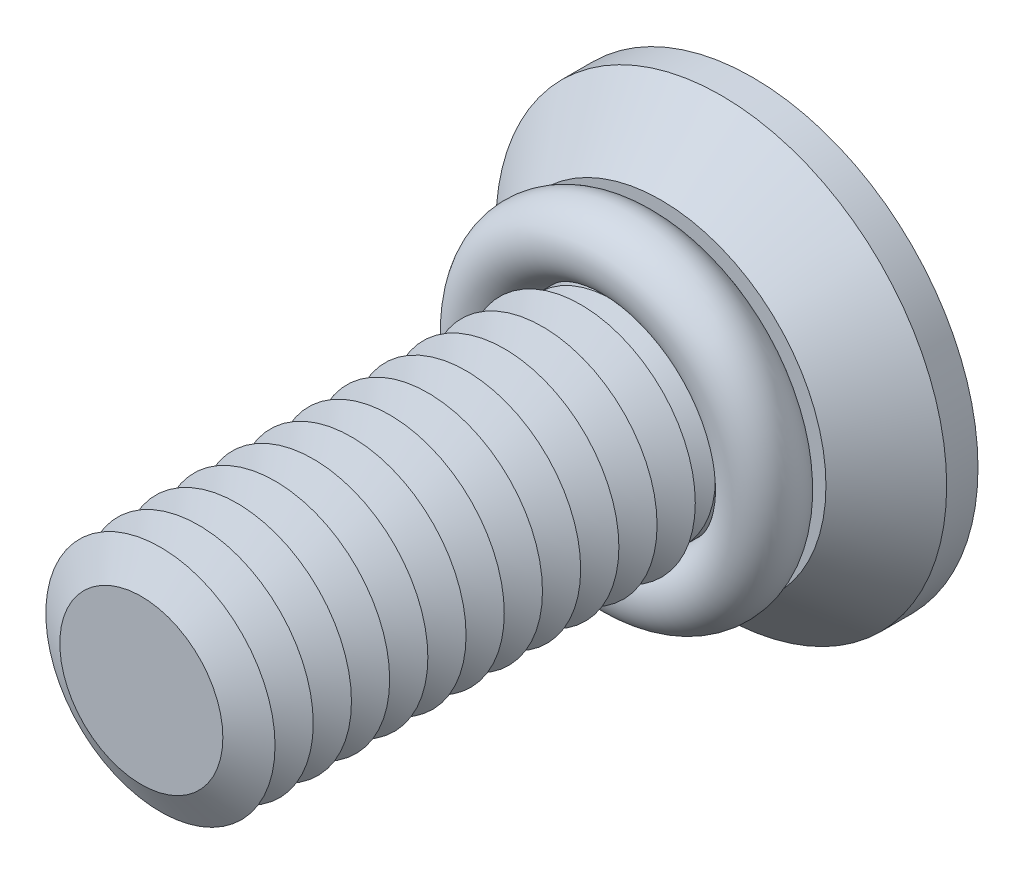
ISO-10303-21;
HEADER;
FILE_DESCRIPTION(('STEP AP214'),'2;1');
FILE_NAME('part.step','',(''),(''),'','','');
FILE_SCHEMA(('AUTOMOTIVE_DESIGN { 1 0 10303 214 1 1 1 1 }'));
ENDSEC;
DATA;
#1=APPLICATION_CONTEXT('core data for automotive mechanical design processes');
#2=APPLICATION_PROTOCOL_DEFINITION('international standard','automotive_design',2000,#1);
#3=PRODUCT_CONTEXT('',#1,'mechanical');
#4=PRODUCT('Part','Part','',(#3));
#5=PRODUCT_RELATED_PRODUCT_CATEGORY('part','',(#4));
#6=PRODUCT_DEFINITION_FORMATION('','',#4);
#7=PRODUCT_DEFINITION_CONTEXT('part definition',#1,'design');
#8=PRODUCT_DEFINITION('design','',#6,#7);
#9=PRODUCT_DEFINITION_SHAPE('','',#8);
#10=(LENGTH_UNIT() NAMED_UNIT(*) SI_UNIT(.MILLI.,.METRE.));
#11=(NAMED_UNIT(*) PLANE_ANGLE_UNIT() SI_UNIT($,.RADIAN.));
#12=(NAMED_UNIT(*) SI_UNIT($,.STERADIAN.) SOLID_ANGLE_UNIT());
#13=UNCERTAINTY_MEASURE_WITH_UNIT(LENGTH_MEASURE(1.E-05),#10,'distance_accuracy_value','');
#14=(GEOMETRIC_REPRESENTATION_CONTEXT(3) GLOBAL_UNCERTAINTY_ASSIGNED_CONTEXT((#13)) GLOBAL_UNIT_ASSIGNED_CONTEXT((#10,
#11,#12)) REPRESENTATION_CONTEXT('',''));
#15=CARTESIAN_POINT('',(0.,0.,0.));
#16=DIRECTION('',(0.,0.,1.));
#17=DIRECTION('',(1.,0.,0.));
#18=AXIS2_PLACEMENT_3D('',#15,#16,#17);
#19=CARTESIAN_POINT('',(0.,0.,3.30000000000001));
#20=DIRECTION('',(0.,0.,1.));
#21=DIRECTION('',(1.,0.,0.));
#22=AXIS2_PLACEMENT_3D('',#19,#20,#21);
#23=TOROIDAL_SURFACE('',#22,3.6,0.9);
#24=CARTESIAN_POINT('',(0.,3.6,3.30000000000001));
#25=DIRECTION('',(1.,0.,0.));
#26=DIRECTION('',(0.,0.,-1.));
#27=AXIS2_PLACEMENT_3D('',#24,#25,#26);
#28=CIRCLE('',#27,0.9);
#29=CARTESIAN_POINT('',(0.,4.5,3.30000000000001));
#30=VERTEX_POINT('',#29);
#31=EDGE_CURVE('P0_E10',#30,#30,#28,.T.);
#32=CARTESIAN_POINT('',(0.,0.,3.30000000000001));
#33=DIRECTION('',(0.,0.,1.));
#34=DIRECTION('',(1.,0.,0.));
#35=AXIS2_PLACEMENT_3D('',#32,#33,#34);
#36=CIRCLE('',#35,4.5);
#37=EDGE_CURVE('',#30,#30,#36,.T.);
#38=ORIENTED_EDGE('',*,*,#31,.F.);
#39=ORIENTED_EDGE('',*,*,#31,.T.);
#40=ORIENTED_EDGE('',*,*,#37,.T.);
#41=ORIENTED_EDGE('',*,*,#37,.F.);
#42=EDGE_LOOP('',(#38,#40,#39,#41));
#43=FACE_BOUND('',#42,.T.);
#44=ADVANCED_FACE('P0_F14',(#43),#23,.T.);
#45=CLOSED_SHELL('',(#44));
#46=MANIFOLD_SOLID_BREP('P0_B1',#45);
#47=CARTESIAN_POINT('',(0.,0.,11.));
#48=DIRECTION('',(0.,0.,-1.));
#49=DIRECTION('',(-1.,0.,0.));
#50=AXIS2_PLACEMENT_3D('',#47,#48,#49);
#51=CONICAL_SURFACE('',#50,2.13397459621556,1.0471975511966);
#52=CARTESIAN_POINT('',(0.,0.,10.5));
#53=DIRECTION('',(0.,0.,1.));
#54=DIRECTION('',(1.,0.,0.));
#55=AXIS2_PLACEMENT_3D('',#52,#53,#54);
#56=CIRCLE('',#55,3.);
#57=CARTESIAN_POINT('',(3.,0.,10.5));
#58=VERTEX_POINT('',#57);
#59=EDGE_CURVE('P1_E324',#58,#58,#56,.T.);
#60=ORIENTED_EDGE('',*,*,#59,.T.);
#61=EDGE_LOOP('',(#60));
#62=FACE_BOUND('',#61,.T.);
#63=CARTESIAN_POINT('',(0.,0.,11.));
#64=DIRECTION('',(0.,0.,1.));
#65=DIRECTION('',(1.,0.,0.));
#66=AXIS2_PLACEMENT_3D('',#63,#64,#65);
#67=CIRCLE('',#66,2.13397459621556);
#68=CARTESIAN_POINT('',(2.13397459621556,0.,11.));
#69=VERTEX_POINT('',#68);
#70=EDGE_CURVE('P1_E321',#69,#69,#67,.T.);
#71=ORIENTED_EDGE('',*,*,#70,.F.);
#72=EDGE_LOOP('',(#71));
#73=FACE_BOUND('',#72,.T.);
#74=ADVANCED_FACE('P1_F15',(#62,#73),#51,.T.);
#75=CARTESIAN_POINT('',(0.,0.,11.5));
#76=DIRECTION('',(0.,0.,1.));
#77=DIRECTION('',(1.,0.,0.));
#78=AXIS2_PLACEMENT_3D('',#75,#76,#77);
#79=CONICAL_SURFACE('',#78,3.,1.0471975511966);
#80=ORIENTED_EDGE('',*,*,#70,.T.);
#81=EDGE_LOOP('',(#80));
#82=FACE_BOUND('',#81,.T.);
#83=CARTESIAN_POINT('',(0.,0.,11.5));
#84=DIRECTION('',(0.,0.,1.));
#85=DIRECTION('',(1.,0.,0.));
#86=AXIS2_PLACEMENT_3D('',#83,#84,#85);
#87=CIRCLE('',#86,3.);
#88=CARTESIAN_POINT('',(3.,0.,11.5));
#89=VERTEX_POINT('',#88);
#90=EDGE_CURVE('P1_E318',#89,#89,#87,.T.);
#91=ORIENTED_EDGE('',*,*,#90,.F.);
#92=EDGE_LOOP('',(#91));
#93=FACE_BOUND('',#92,.T.);
#94=ADVANCED_FACE('P1_F245',(#82,#93),#79,.T.);
#95=CARTESIAN_POINT('',(0.,0.,16.));
#96=DIRECTION('',(0.,0.,1.));
#97=DIRECTION('',(1.,0.,0.));
#98=AXIS2_PLACEMENT_3D('',#95,#96,#97);
#99=PLANE('',#98);
#100=CARTESIAN_POINT('',(0.,0.,16.));
#101=DIRECTION('',(0.,0.,1.));
#102=DIRECTION('',(1.,0.,0.));
#103=AXIS2_PLACEMENT_3D('',#100,#101,#102);
#104=CIRCLE('',#103,2.13397459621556);
#105=CARTESIAN_POINT('',(2.13397459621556,0.,16.));
#106=VERTEX_POINT('',#105);
#107=EDGE_CURVE('P1_E131',#106,#106,#104,.T.);
#108=ORIENTED_EDGE('',*,*,#107,.T.);
#109=EDGE_LOOP('',(#108));
#110=FACE_BOUND('',#109,.T.);
#111=ADVANCED_FACE('P1_F251',(#110),#99,.T.);
#112=CARTESIAN_POINT('',(0.,0.,16.));
#113=DIRECTION('',(0.,0.,-1.));
#114=DIRECTION('',(-1.,0.,0.));
#115=AXIS2_PLACEMENT_3D('',#112,#113,#114);
#116=CONICAL_SURFACE('',#115,2.13397459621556,1.0471975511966);
#117=CARTESIAN_POINT('',(0.,0.,15.5));
#118=DIRECTION('',(0.,0.,1.));
#119=DIRECTION('',(1.,0.,0.));
#120=AXIS2_PLACEMENT_3D('',#117,#118,#119);
#121=CIRCLE('',#120,3.);
#122=CARTESIAN_POINT('',(3.,0.,15.5));
#123=VERTEX_POINT('',#122);
#124=EDGE_CURVE('P1_E133',#123,#123,#121,.T.);
#125=ORIENTED_EDGE('',*,*,#124,.T.);
#126=EDGE_LOOP('',(#125));
#127=FACE_BOUND('',#126,.T.);
#128=ORIENTED_EDGE('',*,*,#107,.F.);
#129=EDGE_LOOP('',(#128));
#130=FACE_BOUND('',#129,.T.);
#131=ADVANCED_FACE('P1_F196',(#127,#130),#116,.T.);
#132=CARTESIAN_POINT('',(0.,0.,15.5));
#133=DIRECTION('',(0.,0.,1.));
#134=DIRECTION('',(1.,0.,0.));
#135=AXIS2_PLACEMENT_3D('',#132,#133,#134);
#136=CONICAL_SURFACE('',#135,3.,1.0471975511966);
#137=CARTESIAN_POINT('',(0.,0.,15.));
#138=DIRECTION('',(0.,0.,1.));
#139=DIRECTION('',(1.,0.,0.));
#140=AXIS2_PLACEMENT_3D('',#137,#138,#139);
#141=CIRCLE('',#140,2.13397459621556);
#142=CARTESIAN_POINT('',(2.13397459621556,0.,15.));
#143=VERTEX_POINT('',#142);
#144=EDGE_CURVE('P1_E297',#143,#143,#141,.T.);
#145=ORIENTED_EDGE('',*,*,#144,.T.);
#146=EDGE_LOOP('',(#145));
#147=FACE_BOUND('',#146,.T.);
#148=ORIENTED_EDGE('',*,*,#124,.F.);
#149=EDGE_LOOP('',(#148));
#150=FACE_BOUND('',#149,.T.);
#151=ADVANCED_FACE('P1_F284',(#147,#150),#136,.T.);
#152=CARTESIAN_POINT('',(0.,0.,15.));
#153=DIRECTION('',(0.,0.,-1.));
#154=DIRECTION('',(-1.,0.,0.));
#155=AXIS2_PLACEMENT_3D('',#152,#153,#154);
#156=CONICAL_SURFACE('',#155,2.13397459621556,1.0471975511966);
#157=CARTESIAN_POINT('',(0.,0.,14.5));
#158=DIRECTION('',(0.,0.,1.));
#159=DIRECTION('',(1.,0.,0.));
#160=AXIS2_PLACEMENT_3D('',#157,#158,#159);
#161=CIRCLE('',#160,3.);
#162=CARTESIAN_POINT('',(3.,0.,14.5));
#163=VERTEX_POINT('',#162);
#164=EDGE_CURVE('P1_E294',#163,#163,#161,.T.);
#165=ORIENTED_EDGE('',*,*,#164,.T.);
#166=EDGE_LOOP('',(#165));
#167=FACE_BOUND('',#166,.T.);
#168=ORIENTED_EDGE('',*,*,#144,.F.);
#169=EDGE_LOOP('',(#168));
#170=FACE_BOUND('',#169,.T.);
#171=ADVANCED_FACE('P1_F279',(#167,#170),#156,.T.);
#172=CARTESIAN_POINT('',(0.,0.,14.5));
#173=DIRECTION('',(0.,0.,1.));
#174=DIRECTION('',(1.,0.,0.));
#175=AXIS2_PLACEMENT_3D('',#172,#173,#174);
#176=CONICAL_SURFACE('',#175,3.,1.0471975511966);
#177=CARTESIAN_POINT('',(0.,0.,14.));
#178=DIRECTION('',(0.,0.,1.));
#179=DIRECTION('',(1.,0.,0.));
#180=AXIS2_PLACEMENT_3D('',#177,#178,#179);
#181=CIRCLE('',#180,2.13397459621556);
#182=CARTESIAN_POINT('',(2.13397459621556,0.,14.));
#183=VERTEX_POINT('',#182);
#184=EDGE_CURVE('P1_E301',#183,#183,#181,.T.);
#185=ORIENTED_EDGE('',*,*,#184,.T.);
#186=EDGE_LOOP('',(#185));
#187=FACE_BOUND('',#186,.T.);
#188=ORIENTED_EDGE('',*,*,#164,.F.);
#189=EDGE_LOOP('',(#188));
#190=FACE_BOUND('',#189,.T.);
#191=ADVANCED_FACE('P1_F276',(#187,#190),#176,.T.);
#192=CARTESIAN_POINT('',(0.,0.,14.));
#193=DIRECTION('',(0.,0.,-1.));
#194=DIRECTION('',(-1.,0.,0.));
#195=AXIS2_PLACEMENT_3D('',#192,#193,#194);
#196=CONICAL_SURFACE('',#195,2.13397459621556,1.0471975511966);
#197=CARTESIAN_POINT('',(0.,0.,13.5));
#198=DIRECTION('',(0.,0.,1.));
#199=DIRECTION('',(1.,0.,0.));
#200=AXIS2_PLACEMENT_3D('',#197,#198,#199);
#201=CIRCLE('',#200,3.);
#202=CARTESIAN_POINT('',(3.,0.,13.5));
#203=VERTEX_POINT('',#202);
#204=EDGE_CURVE('P1_E306',#203,#203,#201,.T.);
#205=ORIENTED_EDGE('',*,*,#204,.T.);
#206=EDGE_LOOP('',(#205));
#207=FACE_BOUND('',#206,.T.);
#208=ORIENTED_EDGE('',*,*,#184,.F.);
#209=EDGE_LOOP('',(#208));
#210=FACE_BOUND('',#209,.T.);
#211=ADVANCED_FACE('P1_F271',(#207,#210),#196,.T.);
#212=CARTESIAN_POINT('',(0.,0.,13.5));
#213=DIRECTION('',(0.,0.,1.));
#214=DIRECTION('',(1.,0.,0.));
#215=AXIS2_PLACEMENT_3D('',#212,#213,#214);
#216=CONICAL_SURFACE('',#215,3.,1.0471975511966);
#217=CARTESIAN_POINT('',(0.,0.,13.));
#218=DIRECTION('',(0.,0.,1.));
#219=DIRECTION('',(1.,0.,0.));
#220=AXIS2_PLACEMENT_3D('',#217,#218,#219);
#221=CIRCLE('',#220,2.13397459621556);
#222=CARTESIAN_POINT('',(2.13397459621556,0.,13.));
#223=VERTEX_POINT('',#222);
#224=EDGE_CURVE('P1_E309',#223,#223,#221,.T.);
#225=ORIENTED_EDGE('',*,*,#224,.T.);
#226=EDGE_LOOP('',(#225));
#227=FACE_BOUND('',#226,.T.);
#228=ORIENTED_EDGE('',*,*,#204,.F.);
#229=EDGE_LOOP('',(#228));
#230=FACE_BOUND('',#229,.T.);
#231=ADVANCED_FACE('P1_F268',(#227,#230),#216,.T.);
#232=CARTESIAN_POINT('',(0.,0.,13.));
#233=DIRECTION('',(0.,0.,-1.));
#234=DIRECTION('',(-1.,0.,0.));
#235=AXIS2_PLACEMENT_3D('',#232,#233,#234);
#236=CONICAL_SURFACE('',#235,2.13397459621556,1.0471975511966);
#237=CARTESIAN_POINT('',(0.,0.,12.5));
#238=DIRECTION('',(0.,0.,1.));
#239=DIRECTION('',(1.,0.,0.));
#240=AXIS2_PLACEMENT_3D('',#237,#238,#239);
#241=CIRCLE('',#240,3.);
#242=CARTESIAN_POINT('',(3.,0.,12.5));
#243=VERTEX_POINT('',#242);
#244=EDGE_CURVE('P1_E312',#243,#243,#241,.T.);
#245=ORIENTED_EDGE('',*,*,#244,.T.);
#246=EDGE_LOOP('',(#245));
#247=FACE_BOUND('',#246,.T.);
#248=ORIENTED_EDGE('',*,*,#224,.F.);
#249=EDGE_LOOP('',(#248));
#250=FACE_BOUND('',#249,.T.);
#251=ADVANCED_FACE('P1_F262',(#247,#250),#236,.T.);
#252=CARTESIAN_POINT('',(0.,0.,12.5));
#253=DIRECTION('',(0.,0.,1.));
#254=DIRECTION('',(1.,0.,0.));
#255=AXIS2_PLACEMENT_3D('',#252,#253,#254);
#256=CONICAL_SURFACE('',#255,3.,1.0471975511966);
#257=CARTESIAN_POINT('',(0.,0.,12.));
#258=DIRECTION('',(0.,0.,1.));
#259=DIRECTION('',(1.,0.,0.));
#260=AXIS2_PLACEMENT_3D('',#257,#258,#259);
#261=CIRCLE('',#260,2.13397459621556);
#262=CARTESIAN_POINT('',(2.13397459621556,0.,12.));
#263=VERTEX_POINT('',#262);
#264=EDGE_CURVE('P1_E315',#263,#263,#261,.T.);
#265=ORIENTED_EDGE('',*,*,#264,.T.);
#266=EDGE_LOOP('',(#265));
#267=FACE_BOUND('',#266,.T.);
#268=ORIENTED_EDGE('',*,*,#244,.F.);
#269=EDGE_LOOP('',(#268));
#270=FACE_BOUND('',#269,.T.);
#271=ADVANCED_FACE('P1_F258',(#267,#270),#256,.T.);
#272=CARTESIAN_POINT('',(0.,0.,12.));
#273=DIRECTION('',(0.,0.,-1.));
#274=DIRECTION('',(-1.,0.,0.));
#275=AXIS2_PLACEMENT_3D('',#272,#273,#274);
#276=CONICAL_SURFACE('',#275,2.13397459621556,1.0471975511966);
#277=ORIENTED_EDGE('',*,*,#90,.T.);
#278=EDGE_LOOP('',(#277));
#279=FACE_BOUND('',#278,.T.);
#280=ORIENTED_EDGE('',*,*,#264,.F.);
#281=EDGE_LOOP('',(#280));
#282=FACE_BOUND('',#281,.T.);
#283=ADVANCED_FACE('P1_F261',(#279,#282),#276,.T.);
#284=CARTESIAN_POINT('',(0.,0.,10.));
#285=DIRECTION('',(0.,0.,-1.));
#286=DIRECTION('',(-1.,0.,0.));
#287=AXIS2_PLACEMENT_3D('',#284,#285,#286);
#288=CONICAL_SURFACE('',#287,2.13397459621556,1.0471975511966);
#289=CARTESIAN_POINT('',(0.,0.,9.5));
#290=DIRECTION('',(0.,0.,1.));
#291=DIRECTION('',(1.,0.,0.));
#292=AXIS2_PLACEMENT_3D('',#289,#290,#291);
#293=CIRCLE('',#292,3.);
#294=CARTESIAN_POINT('',(3.,0.,9.5));
#295=VERTEX_POINT('',#294);
#296=EDGE_CURVE('P1_E329',#295,#295,#293,.T.);
#297=ORIENTED_EDGE('',*,*,#296,.T.);
#298=EDGE_LOOP('',(#297));
#299=FACE_BOUND('',#298,.T.);
#300=CARTESIAN_POINT('',(0.,0.,10.));
#301=DIRECTION('',(0.,0.,1.));
#302=DIRECTION('',(1.,0.,0.));
#303=AXIS2_PLACEMENT_3D('',#300,#301,#302);
#304=CIRCLE('',#303,2.13397459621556);
#305=CARTESIAN_POINT('',(2.13397459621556,0.,10.));
#306=VERTEX_POINT('',#305);
#307=EDGE_CURVE('P1_E326',#306,#306,#304,.T.);
#308=ORIENTED_EDGE('',*,*,#307,.F.);
#309=EDGE_LOOP('',(#308));
#310=FACE_BOUND('',#309,.T.);
#311=ADVANCED_FACE('P1_F266',(#299,#310),#288,.T.);
#312=CARTESIAN_POINT('',(0.,0.,10.5));
#313=DIRECTION('',(0.,0.,1.));
#314=DIRECTION('',(1.,0.,0.));
#315=AXIS2_PLACEMENT_3D('',#312,#313,#314);
#316=CONICAL_SURFACE('',#315,3.,1.0471975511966);
#317=ORIENTED_EDGE('',*,*,#307,.T.);
#318=EDGE_LOOP('',(#317));
#319=FACE_BOUND('',#318,.T.);
#320=ORIENTED_EDGE('',*,*,#59,.F.);
#321=EDGE_LOOP('',(#320));
#322=FACE_BOUND('',#321,.T.);
#323=ADVANCED_FACE('P1_F467',(#319,#322),#316,.T.);
#324=CARTESIAN_POINT('',(0.,0.,9.));
#325=DIRECTION('',(0.,0.,-1.));
#326=DIRECTION('',(-1.,0.,0.));
#327=AXIS2_PLACEMENT_3D('',#324,#325,#326);
#328=CONICAL_SURFACE('',#327,2.13397459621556,1.0471975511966);
#329=CARTESIAN_POINT('',(0.,0.,8.5));
#330=DIRECTION('',(0.,0.,1.));
#331=DIRECTION('',(1.,0.,0.));
#332=AXIS2_PLACEMENT_3D('',#329,#330,#331);
#333=CIRCLE('',#332,3.);
#334=CARTESIAN_POINT('',(3.,0.,8.5));
#335=VERTEX_POINT('',#334);
#336=EDGE_CURVE('P1_E335',#335,#335,#333,.T.);
#337=ORIENTED_EDGE('',*,*,#336,.T.);
#338=EDGE_LOOP('',(#337));
#339=FACE_BOUND('',#338,.T.);
#340=CARTESIAN_POINT('',(0.,0.,9.));
#341=DIRECTION('',(0.,0.,1.));
#342=DIRECTION('',(1.,0.,0.));
#343=AXIS2_PLACEMENT_3D('',#340,#341,#342);
#344=CIRCLE('',#343,2.13397459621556);
#345=CARTESIAN_POINT('',(2.13397459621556,0.,9.));
#346=VERTEX_POINT('',#345);
#347=EDGE_CURVE('P1_E332',#346,#346,#344,.T.);
#348=ORIENTED_EDGE('',*,*,#347,.F.);
#349=EDGE_LOOP('',(#348));
#350=FACE_BOUND('',#349,.T.);
#351=ADVANCED_FACE('P1_F476',(#339,#350),#328,.T.);
#352=CARTESIAN_POINT('',(0.,0.,9.5));
#353=DIRECTION('',(0.,0.,1.));
#354=DIRECTION('',(1.,0.,0.));
#355=AXIS2_PLACEMENT_3D('',#352,#353,#354);
#356=CONICAL_SURFACE('',#355,3.,1.0471975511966);
#357=ORIENTED_EDGE('',*,*,#347,.T.);
#358=EDGE_LOOP('',(#357));
#359=FACE_BOUND('',#358,.T.);
#360=ORIENTED_EDGE('',*,*,#296,.F.);
#361=EDGE_LOOP('',(#360));
#362=FACE_BOUND('',#361,.T.);
#363=ADVANCED_FACE('P1_F486',(#359,#362),#356,.T.);
#364=CARTESIAN_POINT('',(0.,0.,8.));
#365=DIRECTION('',(0.,0.,-1.));
#366=DIRECTION('',(-1.,0.,0.));
#367=AXIS2_PLACEMENT_3D('',#364,#365,#366);
#368=CONICAL_SURFACE('',#367,2.13397459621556,1.0471975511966);
#369=CARTESIAN_POINT('',(0.,0.,7.5));
#370=DIRECTION('',(0.,0.,1.));
#371=DIRECTION('',(1.,0.,0.));
#372=AXIS2_PLACEMENT_3D('',#369,#370,#371);
#373=CIRCLE('',#372,3.);
#374=CARTESIAN_POINT('',(3.,0.,7.5));
#375=VERTEX_POINT('',#374);
#376=EDGE_CURVE('P1_E341',#375,#375,#373,.T.);
#377=ORIENTED_EDGE('',*,*,#376,.T.);
#378=EDGE_LOOP('',(#377));
#379=FACE_BOUND('',#378,.T.);
#380=CARTESIAN_POINT('',(0.,0.,8.));
#381=DIRECTION('',(0.,0.,1.));
#382=DIRECTION('',(1.,0.,0.));
#383=AXIS2_PLACEMENT_3D('',#380,#381,#382);
#384=CIRCLE('',#383,2.13397459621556);
#385=CARTESIAN_POINT('',(2.13397459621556,0.,8.));
#386=VERTEX_POINT('',#385);
#387=EDGE_CURVE('P1_E338',#386,#386,#384,.T.);
#388=ORIENTED_EDGE('',*,*,#387,.F.);
#389=EDGE_LOOP('',(#388));
#390=FACE_BOUND('',#389,.T.);
#391=ADVANCED_FACE('P1_F496',(#379,#390),#368,.T.);
#392=CARTESIAN_POINT('',(0.,0.,8.5));
#393=DIRECTION('',(0.,0.,1.));
#394=DIRECTION('',(1.,0.,0.));
#395=AXIS2_PLACEMENT_3D('',#392,#393,#394);
#396=CONICAL_SURFACE('',#395,3.,1.0471975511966);
#397=ORIENTED_EDGE('',*,*,#387,.T.);
#398=EDGE_LOOP('',(#397));
#399=FACE_BOUND('',#398,.T.);
#400=ORIENTED_EDGE('',*,*,#336,.F.);
#401=EDGE_LOOP('',(#400));
#402=FACE_BOUND('',#401,.T.);
#403=ADVANCED_FACE('P1_F506',(#399,#402),#396,.T.);
#404=CARTESIAN_POINT('',(0.,0.,7.));
#405=DIRECTION('',(0.,0.,-1.));
#406=DIRECTION('',(-1.,0.,0.));
#407=AXIS2_PLACEMENT_3D('',#404,#405,#406);
#408=CONICAL_SURFACE('',#407,2.13397459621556,1.0471975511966);
#409=CARTESIAN_POINT('',(0.,0.,6.5));
#410=DIRECTION('',(0.,0.,1.));
#411=DIRECTION('',(1.,0.,0.));
#412=AXIS2_PLACEMENT_3D('',#409,#410,#411);
#413=CIRCLE('',#412,3.);
#414=CARTESIAN_POINT('',(3.,0.,6.5));
#415=VERTEX_POINT('',#414);
#416=EDGE_CURVE('P1_E347',#415,#415,#413,.T.);
#417=ORIENTED_EDGE('',*,*,#416,.T.);
#418=EDGE_LOOP('',(#417));
#419=FACE_BOUND('',#418,.T.);
#420=CARTESIAN_POINT('',(0.,0.,7.));
#421=DIRECTION('',(0.,0.,1.));
#422=DIRECTION('',(1.,0.,0.));
#423=AXIS2_PLACEMENT_3D('',#420,#421,#422);
#424=CIRCLE('',#423,2.13397459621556);
#425=CARTESIAN_POINT('',(2.13397459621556,0.,7.));
#426=VERTEX_POINT('',#425);
#427=EDGE_CURVE('P1_E344',#426,#426,#424,.T.);
#428=ORIENTED_EDGE('',*,*,#427,.F.);
#429=EDGE_LOOP('',(#428));
#430=FACE_BOUND('',#429,.T.);
#431=ADVANCED_FACE('P1_F516',(#419,#430),#408,.T.);
#432=CARTESIAN_POINT('',(0.,0.,7.5));
#433=DIRECTION('',(0.,0.,1.));
#434=DIRECTION('',(1.,0.,0.));
#435=AXIS2_PLACEMENT_3D('',#432,#433,#434);
#436=CONICAL_SURFACE('',#435,3.,1.0471975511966);
#437=ORIENTED_EDGE('',*,*,#427,.T.);
#438=EDGE_LOOP('',(#437));
#439=FACE_BOUND('',#438,.T.);
#440=ORIENTED_EDGE('',*,*,#376,.F.);
#441=EDGE_LOOP('',(#440));
#442=FACE_BOUND('',#441,.T.);
#443=ADVANCED_FACE('P1_F526',(#439,#442),#436,.T.);
#444=CARTESIAN_POINT('',(0.,0.,6.));
#445=DIRECTION('',(0.,0.,-1.));
#446=DIRECTION('',(-1.,0.,0.));
#447=AXIS2_PLACEMENT_3D('',#444,#445,#446);
#448=CONICAL_SURFACE('',#447,2.13397459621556,1.0471975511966);
#449=CARTESIAN_POINT('',(0.,0.,5.5));
#450=DIRECTION('',(0.,0.,1.));
#451=DIRECTION('',(1.,0.,0.));
#452=AXIS2_PLACEMENT_3D('',#449,#450,#451);
#453=CIRCLE('',#452,3.);
#454=CARTESIAN_POINT('',(3.,0.,5.5));
#455=VERTEX_POINT('',#454);
#456=EDGE_CURVE('P1_E353',#455,#455,#453,.T.);
#457=ORIENTED_EDGE('',*,*,#456,.T.);
#458=EDGE_LOOP('',(#457));
#459=FACE_BOUND('',#458,.T.);
#460=CARTESIAN_POINT('',(0.,0.,6.));
#461=DIRECTION('',(0.,0.,1.));
#462=DIRECTION('',(1.,0.,0.));
#463=AXIS2_PLACEMENT_3D('',#460,#461,#462);
#464=CIRCLE('',#463,2.13397459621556);
#465=CARTESIAN_POINT('',(2.13397459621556,0.,6.));
#466=VERTEX_POINT('',#465);
#467=EDGE_CURVE('P1_E350',#466,#466,#464,.T.);
#468=ORIENTED_EDGE('',*,*,#467,.F.);
#469=EDGE_LOOP('',(#468));
#470=FACE_BOUND('',#469,.T.);
#471=ADVANCED_FACE('P1_F536',(#459,#470),#448,.T.);
#472=CARTESIAN_POINT('',(0.,0.,6.5));
#473=DIRECTION('',(0.,0.,1.));
#474=DIRECTION('',(1.,0.,0.));
#475=AXIS2_PLACEMENT_3D('',#472,#473,#474);
#476=CONICAL_SURFACE('',#475,3.,1.0471975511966);
#477=ORIENTED_EDGE('',*,*,#467,.T.);
#478=EDGE_LOOP('',(#477));
#479=FACE_BOUND('',#478,.T.);
#480=ORIENTED_EDGE('',*,*,#416,.F.);
#481=EDGE_LOOP('',(#480));
#482=FACE_BOUND('',#481,.T.);
#483=ADVANCED_FACE('P1_F546',(#479,#482),#476,.T.);
#484=CARTESIAN_POINT('',(0.,0.,5.));
#485=DIRECTION('',(0.,0.,-1.));
#486=DIRECTION('',(-1.,0.,0.));
#487=AXIS2_PLACEMENT_3D('',#484,#485,#486);
#488=CONICAL_SURFACE('',#487,2.13397459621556,1.0471975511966);
#489=CARTESIAN_POINT('',(0.,0.,4.5));
#490=DIRECTION('',(0.,0.,1.));
#491=DIRECTION('',(1.,0.,0.));
#492=AXIS2_PLACEMENT_3D('',#489,#490,#491);
#493=CIRCLE('',#492,3.);
#494=CARTESIAN_POINT('',(3.,0.,4.5));
#495=VERTEX_POINT('',#494);
#496=EDGE_CURVE('P1_E359',#495,#495,#493,.T.);
#497=ORIENTED_EDGE('',*,*,#496,.T.);
#498=EDGE_LOOP('',(#497));
#499=FACE_BOUND('',#498,.T.);
#500=CARTESIAN_POINT('',(0.,0.,5.));
#501=DIRECTION('',(0.,0.,1.));
#502=DIRECTION('',(1.,0.,0.));
#503=AXIS2_PLACEMENT_3D('',#500,#501,#502);
#504=CIRCLE('',#503,2.13397459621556);
#505=CARTESIAN_POINT('',(2.13397459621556,0.,5.));
#506=VERTEX_POINT('',#505);
#507=EDGE_CURVE('P1_E356',#506,#506,#504,.T.);
#508=ORIENTED_EDGE('',*,*,#507,.F.);
#509=EDGE_LOOP('',(#508));
#510=FACE_BOUND('',#509,.T.);
#511=ADVANCED_FACE('P1_F556',(#499,#510),#488,.T.);
#512=CARTESIAN_POINT('',(0.,0.,5.5));
#513=DIRECTION('',(0.,0.,1.));
#514=DIRECTION('',(1.,0.,0.));
#515=AXIS2_PLACEMENT_3D('',#512,#513,#514);
#516=CONICAL_SURFACE('',#515,3.,1.0471975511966);
#517=ORIENTED_EDGE('',*,*,#507,.T.);
#518=EDGE_LOOP('',(#517));
#519=FACE_BOUND('',#518,.T.);
#520=ORIENTED_EDGE('',*,*,#456,.F.);
#521=EDGE_LOOP('',(#520));
#522=FACE_BOUND('',#521,.T.);
#523=ADVANCED_FACE('P1_F372',(#519,#522),#516,.T.);
#524=CARTESIAN_POINT('',(0.,0.,4.));
#525=DIRECTION('',(0.,0.,-1.));
#526=DIRECTION('',(-1.,0.,0.));
#527=AXIS2_PLACEMENT_3D('',#524,#525,#526);
#528=CONICAL_SURFACE('',#527,2.13397459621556,1.0471975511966);
#529=CARTESIAN_POINT('',(0.,0.,4.));
#530=DIRECTION('',(0.,0.,1.));
#531=DIRECTION('',(1.,0.,0.));
#532=AXIS2_PLACEMENT_3D('',#529,#530,#531);
#533=CIRCLE('',#532,2.13397459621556);
#534=CARTESIAN_POINT('',(2.13397459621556,0.,4.));
#535=VERTEX_POINT('',#534);
#536=EDGE_CURVE('P1_E362',#535,#535,#533,.T.);
#537=ORIENTED_EDGE('',*,*,#536,.F.);
#538=EDGE_LOOP('',(#537));
#539=FACE_BOUND('',#538,.T.);
#540=CARTESIAN_POINT('',(0.,0.,3.67320508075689));
#541=DIRECTION('',(0.,0.,-1.));
#542=DIRECTION('',(-1.,0.,0.));
#543=AXIS2_PLACEMENT_3D('',#540,#541,#542);
#544=CIRCLE('',#543,2.7);
#545=CARTESIAN_POINT('',(-2.7,0.,3.67320508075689));
#546=VERTEX_POINT('',#545);
#547=EDGE_CURVE('P1_E19',#546,#546,#544,.F.);
#548=ORIENTED_EDGE('',*,*,#547,.T.);
#549=EDGE_LOOP('',(#548));
#550=FACE_BOUND('',#549,.T.);
#551=ADVANCED_FACE('P1_F369',(#539,#550),#528,.T.);
#552=CARTESIAN_POINT('',(0.,0.,4.5));
#553=DIRECTION('',(0.,0.,1.));
#554=DIRECTION('',(1.,0.,0.));
#555=AXIS2_PLACEMENT_3D('',#552,#553,#554);
#556=CONICAL_SURFACE('',#555,3.,1.0471975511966);
#557=ORIENTED_EDGE('',*,*,#536,.T.);
#558=EDGE_LOOP('',(#557));
#559=FACE_BOUND('',#558,.T.);
#560=ORIENTED_EDGE('',*,*,#496,.F.);
#561=EDGE_LOOP('',(#560));
#562=FACE_BOUND('',#561,.T.);
#563=ADVANCED_FACE('P1_F366',(#559,#562),#556,.T.);
#564=CARTESIAN_POINT('',(0.,0.,2.5));
#565=DIRECTION('',(0.,0.,-1.));
#566=DIRECTION('',(-1.,0.,0.));
#567=AXIS2_PLACEMENT_3D('',#564,#565,#566);
#568=CONICAL_SURFACE('',#567,2.,1.0471975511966);
#569=CARTESIAN_POINT('',(0.,0.,3.65470053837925));
#570=VERTEX_POINT('',#569);
#571=VERTEX_LOOP('',#570);
#572=FACE_BOUND('',#571,.T.);
#573=CARTESIAN_POINT('',(0.,0.,2.5));
#574=DIRECTION('',(0.,0.,-1.));
#575=DIRECTION('',(-1.,0.,0.));
#576=AXIS2_PLACEMENT_3D('',#573,#574,#575);
#577=CIRCLE('',#576,2.);
#578=CARTESIAN_POINT('',(-2.,0.,2.5));
#579=VERTEX_POINT('',#578);
#580=CARTESIAN_POINT('',(-1.,1.73205080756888,2.5));
#581=VERTEX_POINT('',#580);
#582=EDGE_CURVE('P1_E117',#579,#581,#577,.T.);
#583=ORIENTED_EDGE('',*,*,#582,.T.);
#584=CARTESIAN_POINT('',(0.,0.,2.5));
#585=DIRECTION('',(0.,0.,-1.));
#586=DIRECTION('',(-1.,0.,0.));
#587=AXIS2_PLACEMENT_3D('',#584,#585,#586);
#588=CIRCLE('',#587,2.);
#589=CARTESIAN_POINT('',(1.,1.73205080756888,2.5));
#590=VERTEX_POINT('',#589);
#591=EDGE_CURVE('P1_E24',#581,#590,#588,.T.);
#592=ORIENTED_EDGE('',*,*,#591,.T.);
#593=CARTESIAN_POINT('',(2.,0.,2.5));
#594=VERTEX_POINT('',#593);
#595=EDGE_CURVE('P1_E791',#590,#594,#588,.T.);
#596=ORIENTED_EDGE('',*,*,#595,.T.);
#597=CARTESIAN_POINT('',(1.,-1.73205080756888,2.5));
#598=VERTEX_POINT('',#597);
#599=EDGE_CURVE('P1_E784',#594,#598,#588,.T.);
#600=ORIENTED_EDGE('',*,*,#599,.T.);
#601=CARTESIAN_POINT('',(-1.,-1.73205080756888,2.5));
#602=VERTEX_POINT('',#601);
#603=EDGE_CURVE('P1_E182',#598,#602,#588,.T.);
#604=ORIENTED_EDGE('',*,*,#603,.T.);
#605=EDGE_CURVE('P1_E179',#602,#579,#588,.T.);
#606=ORIENTED_EDGE('',*,*,#605,.T.);
#607=EDGE_LOOP('',(#583,#592,#596,#600,#604,#606));
#608=FACE_BOUND('',#607,.T.);
#609=ADVANCED_FACE('P1_F198',(#572,#608),#568,.F.);
#610=CARTESIAN_POINT('',(0.,0.,2.5));
#611=DIRECTION('',(0.,0.,-1.));
#612=DIRECTION('',(-1.,0.,0.));
#613=AXIS2_PLACEMENT_3D('',#610,#611,#612);
#614=PLANE('',#613);
#615=ORIENTED_EDGE('',*,*,#603,.F.);
#616=DIRECTION('',(-0.866025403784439,-0.5,0.));
#617=VECTOR('',#616,1.);
#618=CARTESIAN_POINT('',(2.,-1.15470053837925,2.5));
#619=LINE('',#618,#617);
#620=CARTESIAN_POINT('',(0.,-2.3094010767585,2.5));
#621=VERTEX_POINT('',#620);
#622=EDGE_CURVE('P1_E800',#598,#621,#619,.T.);
#623=ORIENTED_EDGE('',*,*,#622,.T.);
#624=DIRECTION('',(-0.866025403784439,0.5,0.));
#625=VECTOR('',#624,1.);
#626=CARTESIAN_POINT('',(0.,-2.3094010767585,2.5));
#627=LINE('',#626,#625);
#628=EDGE_CURVE('P1_E807',#621,#602,#627,.T.);
#629=ORIENTED_EDGE('',*,*,#628,.T.);
#630=EDGE_LOOP('',(#615,#623,#629));
#631=FACE_BOUND('',#630,.T.);
#632=ADVANCED_FACE('P1_F598',(#631),#614,.T.);
#633=ORIENTED_EDGE('',*,*,#605,.F.);
#634=CARTESIAN_POINT('',(-2.,-1.15470053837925,2.5));
#635=VERTEX_POINT('',#634);
#636=EDGE_CURVE('P1_E810',#602,#635,#627,.T.);
#637=ORIENTED_EDGE('',*,*,#636,.T.);
#638=DIRECTION('',(0.,1.,0.));
#639=VECTOR('',#638,1.);
#640=CARTESIAN_POINT('',(-2.,-1.15470053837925,2.5));
#641=LINE('',#640,#639);
#642=EDGE_CURVE('P1_E123',#635,#579,#641,.T.);
#643=ORIENTED_EDGE('',*,*,#642,.T.);
#644=EDGE_LOOP('',(#633,#637,#643));
#645=FACE_BOUND('',#644,.T.);
#646=ADVANCED_FACE('P1_F231',(#645),#614,.T.);
#647=ORIENTED_EDGE('',*,*,#582,.F.);
#648=CARTESIAN_POINT('',(-2.,1.15470053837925,2.5));
#649=VERTEX_POINT('',#648);
#650=EDGE_CURVE('P1_E812',#579,#649,#641,.T.);
#651=ORIENTED_EDGE('',*,*,#650,.T.);
#652=DIRECTION('',(0.866025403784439,0.5,0.));
#653=VECTOR('',#652,1.);
#654=CARTESIAN_POINT('',(-2.,1.15470053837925,2.5));
#655=LINE('',#654,#653);
#656=EDGE_CURVE('P1_E815',#649,#581,#655,.T.);
#657=ORIENTED_EDGE('',*,*,#656,.T.);
#658=EDGE_LOOP('',(#647,#651,#657));
#659=FACE_BOUND('',#658,.T.);
#660=ADVANCED_FACE('P1_F615',(#659),#614,.T.);
#661=ORIENTED_EDGE('',*,*,#591,.F.);
#662=CARTESIAN_POINT('',(0.,2.3094010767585,2.5));
#663=VERTEX_POINT('',#662);
#664=EDGE_CURVE('P1_E814',#581,#663,#655,.T.);
#665=ORIENTED_EDGE('',*,*,#664,.T.);
#666=DIRECTION('',(0.866025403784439,-0.5,0.));
#667=VECTOR('',#666,1.);
#668=CARTESIAN_POINT('',(0.,2.3094010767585,2.5));
#669=LINE('',#668,#667);
#670=EDGE_CURVE('P1_E161',#663,#590,#669,.T.);
#671=ORIENTED_EDGE('',*,*,#670,.T.);
#672=EDGE_LOOP('',(#661,#665,#671));
#673=FACE_BOUND('',#672,.T.);
#674=ADVANCED_FACE('P1_F624',(#673),#614,.T.);
#675=ORIENTED_EDGE('',*,*,#595,.F.);
#676=CARTESIAN_POINT('',(2.,1.15470053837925,2.5));
#677=VERTEX_POINT('',#676);
#678=EDGE_CURVE('P1_E799',#590,#677,#669,.T.);
#679=ORIENTED_EDGE('',*,*,#678,.T.);
#680=DIRECTION('',(0.,-1.,0.));
#681=VECTOR('',#680,1.);
#682=CARTESIAN_POINT('',(2.,1.15470053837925,2.5));
#683=LINE('',#682,#681);
#684=EDGE_CURVE('P1_E794',#677,#594,#683,.T.);
#685=ORIENTED_EDGE('',*,*,#684,.T.);
#686=EDGE_LOOP('',(#675,#679,#685));
#687=FACE_BOUND('',#686,.T.);
#688=ADVANCED_FACE('P1_F633',(#687),#614,.T.);
#689=ORIENTED_EDGE('',*,*,#599,.F.);
#690=CARTESIAN_POINT('',(2.,-1.15470053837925,2.5));
#691=VERTEX_POINT('',#690);
#692=EDGE_CURVE('P1_E786',#594,#691,#683,.T.);
#693=ORIENTED_EDGE('',*,*,#692,.T.);
#694=EDGE_CURVE('P1_E125',#691,#598,#619,.T.);
#695=ORIENTED_EDGE('',*,*,#694,.T.);
#696=EDGE_LOOP('',(#689,#693,#695));
#697=FACE_BOUND('',#696,.T.);
#698=ADVANCED_FACE('P1_F229',(#697),#614,.T.);
#699=CARTESIAN_POINT('',(2.,-1.15470053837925,2.5));
#700=DIRECTION('',(0.5,-0.866025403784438,0.));
#701=DIRECTION('',(0.866025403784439,0.5,0.));
#702=AXIS2_PLACEMENT_3D('',#699,#700,#701);
#703=PLANE('',#702);
#704=DIRECTION('',(0.,0.,-1.));
#705=VECTOR('',#704,1.);
#706=CARTESIAN_POINT('',(2.,-1.15470053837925,2.5));
#707=LINE('',#706,#705);
#708=CARTESIAN_POINT('',(2.,-1.15470053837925,0.));
#709=VERTEX_POINT('',#708);
#710=EDGE_CURVE('P1_E164',#691,#709,#707,.T.);
#711=ORIENTED_EDGE('',*,*,#710,.T.);
#712=CARTESIAN_POINT('',(2.0002,-1.15458506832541,-3.09424280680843E-05));
#713=CARTESIAN_POINT('',(1.91712847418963,-1.20254643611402,0.0128270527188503));
#714=CARTESIAN_POINT('',(1.83390630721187,-1.25059477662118,0.0245000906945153));
#715=CARTESIAN_POINT('',(1.66716800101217,-1.3468611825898,0.0450086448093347));
#716=CARTESIAN_POINT('',(1.58365175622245,-1.39507930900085,0.0538430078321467));
#717=CARTESIAN_POINT('',(1.41683177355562,-1.49139287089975,0.0681583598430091));
#718=CARTESIAN_POINT('',(1.33352916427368,-1.53948765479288,0.0736564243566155));
#719=CARTESIAN_POINT('',(1.1668176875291,-1.63573857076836,0.0810287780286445));
#720=CARTESIAN_POINT('',(1.08340884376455,-1.68389468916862,0.0829037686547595));
#721=CARTESIAN_POINT('',(0.916591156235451,-1.78020692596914,0.0829037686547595));
#722=CARTESIAN_POINT('',(0.833182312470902,-1.82836304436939,0.0810287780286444));
#723=CARTESIAN_POINT('',(0.666470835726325,-1.92461396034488,0.0736564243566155));
#724=CARTESIAN_POINT('',(0.583168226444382,-1.972708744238,0.068158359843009));
#725=CARTESIAN_POINT('',(0.416348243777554,-2.06902230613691,0.0538430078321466));
#726=CARTESIAN_POINT('',(0.332831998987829,-2.11724043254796,0.0450086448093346));
#727=CARTESIAN_POINT('',(0.16609369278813,-2.21350683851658,0.0245000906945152));
#728=CARTESIAN_POINT('',(0.0828715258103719,-2.26155517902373,0.0128270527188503));
#729=CARTESIAN_POINT('',(-0.000199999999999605,-2.30951654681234,-3.09424280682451E-05));
#730=B_SPLINE_CURVE_WITH_KNOTS('',3,(#712,#713,#714,#715,#716,#717,#718,#719,#720,#721,#722,
#723,#724,#725,#726,#727,#728,#729),.UNSPECIFIED.,.F.,.F.,(4,2,2,2,2,2,2,2,4),(0.,
0.290357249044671,0.580832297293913,0.869807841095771,1.15872743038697,1.44764701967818,
1.73662256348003,2.02709761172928,2.31745486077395),.UNSPECIFIED.);
#731=CARTESIAN_POINT('',(0.,-2.3094010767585,0.));
#732=VERTEX_POINT('',#731);
#733=EDGE_CURVE('P1_E118',#709,#732,#730,.T.);
#734=ORIENTED_EDGE('',*,*,#733,.T.);
#735=DIRECTION('',(0.,0.,-1.));
#736=VECTOR('',#735,1.);
#737=CARTESIAN_POINT('',(0.,-2.3094010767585,2.5));
#738=LINE('',#737,#736);
#739=EDGE_CURVE('P1_E116',#621,#732,#738,.T.);
#740=ORIENTED_EDGE('',*,*,#739,.F.);
#741=ORIENTED_EDGE('',*,*,#622,.F.);
#742=ORIENTED_EDGE('',*,*,#694,.F.);
#743=EDGE_LOOP('',(#711,#734,#740,#741,#742));
#744=FACE_BOUND('',#743,.T.);
#745=ADVANCED_FACE('P1_F226',(#744),#703,.F.);
#746=CARTESIAN_POINT('',(0.,-2.3094010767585,2.5));
#747=DIRECTION('',(-0.5,-0.866025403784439,0.));
#748=DIRECTION('',(0.866025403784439,-0.5,0.));
#749=AXIS2_PLACEMENT_3D('',#746,#747,#748);
#750=PLANE('',#749);
#751=ORIENTED_EDGE('',*,*,#739,.T.);
#752=CARTESIAN_POINT('',(0.000200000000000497,-2.30951654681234,-3.09424280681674E-05));
#753=CARTESIAN_POINT('',(-0.0828715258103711,-2.26155517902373,0.0128270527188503));
#754=CARTESIAN_POINT('',(-0.166093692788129,-2.21350683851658,0.0245000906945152));
#755=CARTESIAN_POINT('',(-0.332831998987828,-2.11724043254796,0.0450086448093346));
#756=CARTESIAN_POINT('',(-0.416348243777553,-2.06902230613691,0.0538430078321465));
#757=CARTESIAN_POINT('',(-0.583168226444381,-1.972708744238,0.068158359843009));
#758=CARTESIAN_POINT('',(-0.666470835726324,-1.92461396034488,0.0736564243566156));
#759=CARTESIAN_POINT('',(-0.833182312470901,-1.82836304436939,0.0810287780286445));
#760=CARTESIAN_POINT('',(-0.916591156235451,-1.78020692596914,0.0829037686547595));
#761=CARTESIAN_POINT('',(-1.08340884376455,-1.68389468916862,0.0829037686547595));
#762=CARTESIAN_POINT('',(-1.1668176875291,-1.63573857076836,0.0810287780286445));
#763=CARTESIAN_POINT('',(-1.33352916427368,-1.53948765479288,0.0736564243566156));
#764=CARTESIAN_POINT('',(-1.41683177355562,-1.49139287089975,0.0681583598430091));
#765=CARTESIAN_POINT('',(-1.58365175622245,-1.39507930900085,0.0538430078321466));
#766=CARTESIAN_POINT('',(-1.66716800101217,-1.3468611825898,0.0450086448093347));
#767=CARTESIAN_POINT('',(-1.83390630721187,-1.25059477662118,0.0245000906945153));
#768=CARTESIAN_POINT('',(-1.91712847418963,-1.20254643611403,0.0128270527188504));
#769=CARTESIAN_POINT('',(-2.0002,-1.15458506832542,-3.09424280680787E-05));
#770=B_SPLINE_CURVE_WITH_KNOTS('',3,(#752,#753,#754,#755,#756,#757,#758,#759,#760,#761,#762,
#763,#764,#765,#766,#767,#768,#769),.UNSPECIFIED.,.F.,.F.,(4,2,2,2,2,2,2,2,4),(0.,
0.29035724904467,0.580832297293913,0.869807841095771,1.15872743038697,1.44764701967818,
1.73662256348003,2.02709761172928,2.31745486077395),.UNSPECIFIED.);
#771=CARTESIAN_POINT('',(-2.,-1.15470053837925,0.));
#772=VERTEX_POINT('',#771);
#773=EDGE_CURVE('P1_E94',#732,#772,#770,.T.);
#774=ORIENTED_EDGE('',*,*,#773,.T.);
#775=DIRECTION('',(0.,0.,-1.));
#776=VECTOR('',#775,1.);
#777=CARTESIAN_POINT('',(-2.,-1.15470053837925,2.5));
#778=LINE('',#777,#776);
#779=EDGE_CURVE('P1_E112',#635,#772,#778,.T.);
#780=ORIENTED_EDGE('',*,*,#779,.F.);
#781=ORIENTED_EDGE('',*,*,#636,.F.);
#782=ORIENTED_EDGE('',*,*,#628,.F.);
#783=EDGE_LOOP('',(#751,#774,#780,#781,#782));
#784=FACE_BOUND('',#783,.T.);
#785=ADVANCED_FACE('P1_F110',(#784),#750,.F.);
#786=CARTESIAN_POINT('',(-2.,-1.15470053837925,2.5));
#787=DIRECTION('',(-1.,0.,0.));
#788=DIRECTION('',(0.,-1.,0.));
#789=AXIS2_PLACEMENT_3D('',#786,#787,#788);
#790=PLANE('',#789);
#791=ORIENTED_EDGE('',*,*,#779,.T.);
#792=CARTESIAN_POINT('',(-2.,-3.01440758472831,-0.350516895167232));
#793=CARTESIAN_POINT('',(-2.,-2.92409762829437,-0.330356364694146));
#794=CARTESIAN_POINT('',(-2.,-2.83373054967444,-0.310452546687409));
#795=CARTESIAN_POINT('',(-2.,-2.65285291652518,-0.271288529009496));
#796=CARTESIAN_POINT('',(-2.,-2.56234235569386,-0.252028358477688));
#797=CARTESIAN_POINT('',(-2.,-2.29037985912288,-0.195373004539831));
#798=CARTESIAN_POINT('',(-2.,-2.10868043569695,-0.159144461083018));
#799=CARTESIAN_POINT('',(-2.,-1.74597297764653,-0.0917168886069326));
#800=CARTESIAN_POINT('',(-2.,-1.5649726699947,-0.0604768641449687));
#801=CARTESIAN_POINT('',(-2.,-1.20186568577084,-0.00513826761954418));
#802=CARTESIAN_POINT('',(-2.,-1.01975924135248,0.0189617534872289));
#803=CARTESIAN_POINT('',(-2.,-0.744747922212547,0.0474098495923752));
#804=CARTESIAN_POINT('',(-2.,-0.652245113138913,0.0556328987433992));
#805=CARTESIAN_POINT('',(-2.,-0.467020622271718,0.0690059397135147));
#806=CARTESIAN_POINT('',(-2.,-0.374298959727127,0.0741561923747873));
#807=CARTESIAN_POINT('',(-2.,-0.188764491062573,0.081084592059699));
#808=CARTESIAN_POINT('',(-2.,-0.0959517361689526,0.082864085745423));
#809=CARTESIAN_POINT('',(-2.,0.0896753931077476,0.0829421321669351));
#810=CARTESIAN_POINT('',(-2.,0.182489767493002,0.0812406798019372));
#811=CARTESIAN_POINT('',(-2.,0.368369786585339,0.074451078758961));
#812=CARTESIAN_POINT('',(-2.,0.461434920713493,0.0693492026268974));
#813=CARTESIAN_POINT('',(-2.,0.647346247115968,0.0560433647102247));
#814=CARTESIAN_POINT('',(-2.,0.7401924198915,0.0478391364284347));
#815=CARTESIAN_POINT('',(-2.,1.01841374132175,0.0191822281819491));
#816=CARTESIAN_POINT('',(-2.,1.20337134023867,-0.00531018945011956));
#817=CARTESIAN_POINT('',(-2.,1.5769439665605,-0.0623620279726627));
#818=CARTESIAN_POINT('',(-2.,1.76552771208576,-0.0951161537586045));
#819=CARTESIAN_POINT('',(-2.,2.14178491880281,-0.165570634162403));
#820=CARTESIAN_POINT('',(-2.,2.32945822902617,-0.203271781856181));
#821=CARTESIAN_POINT('',(-2.,2.70417911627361,-0.281883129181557));
#822=CARTESIAN_POINT('',(-2.,2.89122649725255,-0.322794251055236));
#823=CARTESIAN_POINT('',(-2.,3.264844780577,-0.406742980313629));
#824=CARTESIAN_POINT('',(-2.,3.45141567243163,-0.449780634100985));
#825=CARTESIAN_POINT('',(-2.,3.82193813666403,-0.536781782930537));
#826=CARTESIAN_POINT('',(-2.,4.00589388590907,-0.580727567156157));
#827=CARTESIAN_POINT('',(-2.,4.37356350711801,-0.669635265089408));
#828=CARTESIAN_POINT('',(-2.,4.55727737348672,-0.714597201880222));
#829=CARTESIAN_POINT('',(-2.,4.9242660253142,-0.805198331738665));
#830=CARTESIAN_POINT('',(-2.,5.10754106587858,-0.850836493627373));
#831=CARTESIAN_POINT('',(-2.,5.47394280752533,-0.942676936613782));
#832=CARTESIAN_POINT('',(-2.,5.65706951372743,-0.988879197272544));
#833=CARTESIAN_POINT('',(-2.,5.8401458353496,-1.03527803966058));
#834=B_SPLINE_CURVE_WITH_KNOTS('',3,(#792,#793,#794,#795,#796,#797,#798,#799,#800,#801,#802,
#803,#804,#805,#806,#807,#808,#809,#810,#811,#812,#813,#814,#815,#816,#817,#818,#819,#820,#821,
#822,#823,#824,#825,#826,#827,#828,#829,#830,#831,#832,#833),.UNSPECIFIED.,.F.,.F.,(4,2,2,2,2,2,
2,2,2,2,2,2,2,2,2,2,2,2,2,2,4),(0.,0.277597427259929,0.555207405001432,1.11099118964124,
1.6619420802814,2.21278108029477,2.49134108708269,2.76987744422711,3.04830249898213,
3.32672796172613,3.60628428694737,3.88586463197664,4.4453261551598,5.01945893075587,
5.59368386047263,6.16807437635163,6.74247743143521,7.30986991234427,7.87727529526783,
8.44388991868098,9.01048407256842),.UNSPECIFIED.);
#835=CARTESIAN_POINT('',(-2.,1.15470053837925,0.));
#836=VERTEX_POINT('',#835);
#837=EDGE_CURVE('P1_E10',#772,#836,#834,.T.);
#838=ORIENTED_EDGE('',*,*,#837,.T.);
#839=DIRECTION('',(0.,0.,-1.));
#840=VECTOR('',#839,1.);
#841=CARTESIAN_POINT('',(-2.,1.15470053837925,2.5));
#842=LINE('',#841,#840);
#843=EDGE_CURVE('P1_E124',#649,#836,#842,.T.);
#844=ORIENTED_EDGE('',*,*,#843,.F.);
#845=ORIENTED_EDGE('',*,*,#650,.F.);
#846=ORIENTED_EDGE('',*,*,#642,.F.);
#847=EDGE_LOOP('',(#791,#838,#844,#845,#846));
#848=FACE_BOUND('',#847,.T.);
#849=ADVANCED_FACE('P1_F120',(#848),#790,.F.);
#850=CARTESIAN_POINT('',(-2.,1.15470053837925,2.5));
#851=DIRECTION('',(-0.5,0.866025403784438,0.));
#852=DIRECTION('',(-0.866025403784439,-0.5,0.));
#853=AXIS2_PLACEMENT_3D('',#850,#851,#852);
#854=PLANE('',#853);
#855=ORIENTED_EDGE('',*,*,#843,.T.);
#856=CARTESIAN_POINT('',(-2.0002,1.15458506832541,-3.09424280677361E-05));
#857=CARTESIAN_POINT('',(-1.91712847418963,1.20254643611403,0.0128270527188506));
#858=CARTESIAN_POINT('',(-1.83390630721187,1.25059477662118,0.0245000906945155));
#859=CARTESIAN_POINT('',(-1.66716800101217,1.3468611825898,0.045008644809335));
#860=CARTESIAN_POINT('',(-1.58365175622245,1.39507930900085,0.0538430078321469));
#861=CARTESIAN_POINT('',(-1.41683177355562,1.49139287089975,0.0681583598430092));
#862=CARTESIAN_POINT('',(-1.33352916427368,1.53948765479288,0.0736564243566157));
#863=CARTESIAN_POINT('',(-1.1668176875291,1.63573857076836,0.0810287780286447));
#864=CARTESIAN_POINT('',(-1.08340884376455,1.68389468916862,0.0829037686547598));
#865=CARTESIAN_POINT('',(-0.916591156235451,1.78020692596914,0.0829037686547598));
#866=CARTESIAN_POINT('',(-0.833182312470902,1.82836304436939,0.0810287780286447));
#867=CARTESIAN_POINT('',(-0.666470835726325,1.92461396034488,0.0736564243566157));
#868=CARTESIAN_POINT('',(-0.583168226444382,1.972708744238,0.0681583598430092));
#869=CARTESIAN_POINT('',(-0.416348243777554,2.0690223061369,0.0538430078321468));
#870=CARTESIAN_POINT('',(-0.332831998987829,2.11724043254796,0.0450086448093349));
#871=CARTESIAN_POINT('',(-0.16609369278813,2.21350683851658,0.0245000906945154));
#872=CARTESIAN_POINT('',(-0.0828715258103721,2.26155517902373,0.0128270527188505));
#873=CARTESIAN_POINT('',(0.000199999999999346,2.30951654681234,-3.09424280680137E-05));
#874=B_SPLINE_CURVE_WITH_KNOTS('',3,(#856,#857,#858,#859,#860,#861,#862,#863,#864,#865,#866,
#867,#868,#869,#870,#871,#872,#873),.UNSPECIFIED.,.F.,.F.,(4,2,2,2,2,2,2,2,4),(0.,
0.29035724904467,0.580832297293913,0.86980784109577,1.15872743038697,1.44764701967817,
1.73662256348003,2.02709761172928,2.31745486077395),.UNSPECIFIED.);
#875=CARTESIAN_POINT('',(0.,2.3094010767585,0.));
#876=VERTEX_POINT('',#875);
#877=EDGE_CURVE('P1_E136',#836,#876,#874,.T.);
#878=ORIENTED_EDGE('',*,*,#877,.T.);
#879=DIRECTION('',(0.,0.,-1.));
#880=VECTOR('',#879,1.);
#881=CARTESIAN_POINT('',(0.,2.3094010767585,2.5));
#882=LINE('',#881,#880);
#883=EDGE_CURVE('P1_E155',#663,#876,#882,.T.);
#884=ORIENTED_EDGE('',*,*,#883,.F.);
#885=ORIENTED_EDGE('',*,*,#664,.F.);
#886=ORIENTED_EDGE('',*,*,#656,.F.);
#887=EDGE_LOOP('',(#855,#878,#884,#885,#886));
#888=FACE_BOUND('',#887,.T.);
#889=ADVANCED_FACE('P1_F153',(#888),#854,.F.);
#890=CARTESIAN_POINT('',(0.,2.3094010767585,2.5));
#891=DIRECTION('',(0.5,0.866025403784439,0.));
#892=DIRECTION('',(-0.866025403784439,0.5,0.));
#893=AXIS2_PLACEMENT_3D('',#890,#891,#892);
#894=PLANE('',#893);
#895=ORIENTED_EDGE('',*,*,#883,.T.);
#896=CARTESIAN_POINT('',(-0.000200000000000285,2.30951654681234,-3.0942428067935E-05));
#897=CARTESIAN_POINT('',(0.0828715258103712,2.26155517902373,0.0128270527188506));
#898=CARTESIAN_POINT('',(0.166093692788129,2.21350683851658,0.0245000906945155));
#899=CARTESIAN_POINT('',(0.332831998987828,2.11724043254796,0.0450086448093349));
#900=CARTESIAN_POINT('',(0.416348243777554,2.0690223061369,0.0538430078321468));
#901=CARTESIAN_POINT('',(0.583168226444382,1.972708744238,0.0681583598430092));
#902=CARTESIAN_POINT('',(0.666470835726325,1.92461396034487,0.0736564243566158));
#903=CARTESIAN_POINT('',(0.833182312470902,1.82836304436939,0.0810287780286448));
#904=CARTESIAN_POINT('',(0.916591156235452,1.78020692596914,0.0829037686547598));
#905=CARTESIAN_POINT('',(1.08340884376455,1.68389468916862,0.0829037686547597));
#906=CARTESIAN_POINT('',(1.1668176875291,1.63573857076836,0.0810287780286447));
#907=CARTESIAN_POINT('',(1.33352916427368,1.53948765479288,0.0736564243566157));
#908=CARTESIAN_POINT('',(1.41683177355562,1.49139287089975,0.0681583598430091));
#909=CARTESIAN_POINT('',(1.58365175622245,1.39507930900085,0.0538430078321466));
#910=CARTESIAN_POINT('',(1.66716800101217,1.3468611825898,0.0450086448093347));
#911=CARTESIAN_POINT('',(1.83390630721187,1.25059477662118,0.0245000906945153));
#912=CARTESIAN_POINT('',(1.91712847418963,1.20254643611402,0.0128270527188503));
#913=CARTESIAN_POINT('',(2.0002,1.15458506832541,-3.09424280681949E-05));
#914=B_SPLINE_CURVE_WITH_KNOTS('',3,(#896,#897,#898,#899,#900,#901,#902,#903,#904,#905,#906,
#907,#908,#909,#910,#911,#912,#913),.UNSPECIFIED.,.F.,.F.,(4,2,2,2,2,2,2,2,4),(0.,
0.290357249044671,0.580832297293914,0.869807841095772,1.15872743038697,1.44764701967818,
1.73662256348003,2.02709761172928,2.31745486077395),.UNSPECIFIED.);
#915=CARTESIAN_POINT('',(2.,1.15470053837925,0.));
#916=VERTEX_POINT('',#915);
#917=EDGE_CURVE('P1_E141',#876,#916,#914,.T.);
#918=ORIENTED_EDGE('',*,*,#917,.T.);
#919=DIRECTION('',(0.,0.,-1.));
#920=VECTOR('',#919,1.);
#921=CARTESIAN_POINT('',(2.,1.15470053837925,2.5));
#922=LINE('',#921,#920);
#923=EDGE_CURVE('P1_E162',#677,#916,#922,.T.);
#924=ORIENTED_EDGE('',*,*,#923,.F.);
#925=ORIENTED_EDGE('',*,*,#678,.F.);
#926=ORIENTED_EDGE('',*,*,#670,.F.);
#927=EDGE_LOOP('',(#895,#918,#924,#925,#926));
#928=FACE_BOUND('',#927,.T.);
#929=ADVANCED_FACE('P1_F158',(#928),#894,.F.);
#930=CARTESIAN_POINT('',(2.,1.15470053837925,2.5));
#931=DIRECTION('',(1.,0.,0.));
#932=DIRECTION('',(0.,1.,0.));
#933=AXIS2_PLACEMENT_3D('',#930,#931,#932);
#934=PLANE('',#933);
#935=ORIENTED_EDGE('',*,*,#923,.T.);
#936=CARTESIAN_POINT('',(2.,-3.01440758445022,-0.350516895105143));
#937=CARTESIAN_POINT('',(2.,-2.92409762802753,-0.330356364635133));
#938=CARTESIAN_POINT('',(2.,-2.83373054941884,-0.31045254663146));
#939=CARTESIAN_POINT('',(2.,-2.65285291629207,-0.271288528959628));
#940=CARTESIAN_POINT('',(2.,-2.562342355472,-0.252028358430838));
#941=CARTESIAN_POINT('',(2.,-2.29037985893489,-0.195373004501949));
#942=CARTESIAN_POINT('',(2.,-2.10868043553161,-0.159144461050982));
#943=CARTESIAN_POINT('',(2.,-1.74597297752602,-0.0917168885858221));
#944=CARTESIAN_POINT('',(2.,-1.56497266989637,-0.0604768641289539));
#945=CARTESIAN_POINT('',(2.,-1.20186568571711,-0.00513826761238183));
#946=CARTESIAN_POINT('',(2.,-1.01975924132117,0.0189617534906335));
#947=CARTESIAN_POINT('',(2.,-0.744747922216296,0.047409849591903));
#948=CARTESIAN_POINT('',(2.,-0.652245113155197,0.0556328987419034));
#949=CARTESIAN_POINT('',(2.,-0.467020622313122,0.0690059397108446));
#950=CARTESIAN_POINT('',(2.,-0.374298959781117,0.0741561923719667));
#951=CARTESIAN_POINT('',(2.,-0.188764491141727,0.081084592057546));
#952=CARTESIAN_POINT('',(2.,-0.0959517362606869,0.0828640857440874));
#953=CARTESIAN_POINT('',(2.,0.0896753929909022,0.0829421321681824));
#954=CARTESIAN_POINT('',(2.,0.182489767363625,0.0812406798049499));
#955=CARTESIAN_POINT('',(2.,0.368369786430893,0.074451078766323));
#956=CARTESIAN_POINT('',(2.,0.461434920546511,0.0693492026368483));
#957=CARTESIAN_POINT('',(2.,0.647346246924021,0.0560433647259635));
#958=CARTESIAN_POINT('',(2.,0.740192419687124,0.0478391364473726));
#959=CARTESIAN_POINT('',(2.,1.01841374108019,0.0191822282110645));
#960=CARTESIAN_POINT('',(2.,1.2033713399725,-0.00531018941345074));
#961=CARTESIAN_POINT('',(2.,1.57694396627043,-0.0623620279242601));
#962=CARTESIAN_POINT('',(2.,1.76552771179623,-0.0951161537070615));
#963=CARTESIAN_POINT('',(2.,2.14178491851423,-0.165570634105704));
#964=CARTESIAN_POINT('',(2.,2.32945822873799,-0.203271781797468));
#965=CARTESIAN_POINT('',(2.,2.70417911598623,-0.281883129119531));
#966=CARTESIAN_POINT('',(2.,2.89122649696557,-0.322794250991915));
#967=CARTESIAN_POINT('',(2.,3.26484478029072,-0.406742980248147));
#968=CARTESIAN_POINT('',(2.,3.45141567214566,-0.449780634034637));
#969=CARTESIAN_POINT('',(2.,3.821938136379,-0.536781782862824));
#970=CARTESIAN_POINT('',(2.,4.00589388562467,-0.580727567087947));
#971=CARTESIAN_POINT('',(2.,4.37356350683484,-0.669635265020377));
#972=CARTESIAN_POINT('',(2.,4.55727737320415,-0.714597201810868));
#973=CARTESIAN_POINT('',(2.,4.9242660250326,-0.805198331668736));
#974=CARTESIAN_POINT('',(2.,5.10754106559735,-0.85083649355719));
#975=CARTESIAN_POINT('',(2.,5.47394280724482,-0.942676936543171));
#976=CARTESIAN_POINT('',(2.,5.65706951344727,-0.98887919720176));
#977=CARTESIAN_POINT('',(2.,5.84014583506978,-1.03527803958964));
#978=B_SPLINE_CURVE_WITH_KNOTS('',3,(#936,#937,#938,#939,#940,#941,#942,#943,#944,#945,#946,
#947,#948,#949,#950,#951,#952,#953,#954,#955,#956,#957,#958,#959,#960,#961,#962,#963,#964,#965,
#966,#967,#968,#969,#970,#971,#972,#973,#974,#975,#976,#977),.UNSPECIFIED.,.F.,.F.,(4,2,2,2,2,2,
2,2,2,2,2,2,2,2,2,2,2,2,2,2,4),(0.,0.277597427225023,0.555207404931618,1.11099118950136,
1.66194208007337,2.21278108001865,2.49134108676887,2.76987744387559,3.04830249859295,
3.32672796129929,3.60628428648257,3.88586463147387,4.44532615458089,5.0194589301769,
5.59368385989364,6.16807437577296,6.74247743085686,7.30986991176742,7.87727529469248,
8.44388991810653,9.01048407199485),.UNSPECIFIED.);
#979=EDGE_CURVE('P1_E149',#916,#709,#978,.F.);
#980=ORIENTED_EDGE('',*,*,#979,.T.);
#981=ORIENTED_EDGE('',*,*,#710,.F.);
#982=ORIENTED_EDGE('',*,*,#692,.F.);
#983=ORIENTED_EDGE('',*,*,#684,.F.);
#984=EDGE_LOOP('',(#935,#980,#981,#982,#983));
#985=FACE_BOUND('',#984,.T.);
#986=ADVANCED_FACE('P1_F232',(#985),#934,.F.);
#987=CARTESIAN_POINT('',(0.,0.,0.));
#988=DIRECTION('',(0.,0.,-1.));
#989=DIRECTION('',(-1.,0.,0.));
#990=AXIS2_PLACEMENT_3D('',#987,#988,#989);
#991=CONICAL_SURFACE('',#990,2.3094010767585,1.30899693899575);
#992=CARTESIAN_POINT('',(0.,0.,0.));
#993=DIRECTION('',(0.,0.,-1.));
#994=DIRECTION('',(-1.,0.,0.));
#995=AXIS2_PLACEMENT_3D('',#992,#993,#994);
#996=CIRCLE('',#995,2.3094010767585);
#997=EDGE_CURVE('P1_E30',#709,#732,#996,.T.);
#998=ORIENTED_EDGE('',*,*,#997,.T.);
#999=ORIENTED_EDGE('',*,*,#733,.F.);
#1000=EDGE_LOOP('',(#998,#999));
#1001=FACE_BOUND('',#1000,.T.);
#1002=ADVANCED_FACE('P1_F195',(#1001),#991,.F.);
#1003=EDGE_CURVE('P1_E90',#732,#772,#996,.T.);
#1004=ORIENTED_EDGE('',*,*,#1003,.T.);
#1005=ORIENTED_EDGE('',*,*,#773,.F.);
#1006=EDGE_LOOP('',(#1004,#1005));
#1007=FACE_BOUND('',#1006,.T.);
#1008=ADVANCED_FACE('P1_F92',(#1007),#991,.F.);
#1009=EDGE_CURVE('P1_E98',#772,#836,#996,.T.);
#1010=ORIENTED_EDGE('',*,*,#1009,.T.);
#1011=ORIENTED_EDGE('',*,*,#837,.F.);
#1012=EDGE_LOOP('',(#1010,#1011));
#1013=FACE_BOUND('',#1012,.T.);
#1014=ADVANCED_FACE('P1_F102',(#1013),#991,.F.);
#1015=EDGE_CURVE('P1_E130',#836,#876,#996,.T.);
#1016=ORIENTED_EDGE('',*,*,#1015,.T.);
#1017=ORIENTED_EDGE('',*,*,#877,.F.);
#1018=EDGE_LOOP('',(#1016,#1017));
#1019=FACE_BOUND('',#1018,.T.);
#1020=ADVANCED_FACE('P1_F707',(#1019),#991,.F.);
#1021=EDGE_CURVE('P1_E137',#876,#916,#996,.T.);
#1022=ORIENTED_EDGE('',*,*,#1021,.T.);
#1023=ORIENTED_EDGE('',*,*,#917,.F.);
#1024=EDGE_LOOP('',(#1022,#1023));
#1025=FACE_BOUND('',#1024,.T.);
#1026=ADVANCED_FACE('P1_F144',(#1025),#991,.F.);
#1027=EDGE_CURVE('P1_E37',#916,#709,#996,.T.);
#1028=ORIENTED_EDGE('',*,*,#1027,.T.);
#1029=ORIENTED_EDGE('',*,*,#979,.F.);
#1030=EDGE_LOOP('',(#1028,#1029));
#1031=FACE_BOUND('',#1030,.T.);
#1032=ADVANCED_FACE('P1_F693',(#1031),#991,.F.);
#1033=CARTESIAN_POINT('',(0.,0.,0.));
#1034=DIRECTION('',(0.,0.,1.));
#1035=DIRECTION('',(1.,0.,0.));
#1036=AXIS2_PLACEMENT_3D('',#1033,#1034,#1035);
#1037=PLANE('',#1036);
#1038=ORIENTED_EDGE('',*,*,#1027,.F.);
#1039=ORIENTED_EDGE('',*,*,#1021,.F.);
#1040=ORIENTED_EDGE('',*,*,#1015,.F.);
#1041=ORIENTED_EDGE('',*,*,#1009,.F.);
#1042=ORIENTED_EDGE('',*,*,#1003,.F.);
#1043=ORIENTED_EDGE('',*,*,#997,.F.);
#1044=EDGE_LOOP('',(#1038,#1039,#1040,#1041,#1042,#1043));
#1045=FACE_BOUND('',#1044,.T.);
#1046=CARTESIAN_POINT('',(0.,0.,0.));
#1047=DIRECTION('',(0.,0.,-1.));
#1048=DIRECTION('',(-1.,0.,0.));
#1049=AXIS2_PLACEMENT_3D('',#1046,#1047,#1048);
#1050=CIRCLE('',#1049,5.9);
#1051=CARTESIAN_POINT('',(-5.9,0.,0.));
#1052=VERTEX_POINT('',#1051);
#1053=EDGE_CURVE('P1_E169',#1052,#1052,#1050,.T.);
#1054=ORIENTED_EDGE('',*,*,#1053,.T.);
#1055=EDGE_LOOP('',(#1054));
#1056=FACE_BOUND('',#1055,.T.);
#1057=ADVANCED_FACE('P1_F17',(#1045,#1056),#1037,.F.);
#1058=CARTESIAN_POINT('',(0.,0.,16.));
#1059=DIRECTION('',(0.,0.,-1.));
#1060=DIRECTION('',(-1.,0.,0.));
#1061=AXIS2_PLACEMENT_3D('',#1058,#1059,#1060);
#1062=CYLINDRICAL_SURFACE('',#1061,5.9);
#1063=ORIENTED_EDGE('',*,*,#1053,.F.);
#1064=EDGE_LOOP('',(#1063));
#1065=FACE_BOUND('',#1064,.T.);
#1066=CARTESIAN_POINT('',(0.,0.,0.819999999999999));
#1067=DIRECTION('',(0.,0.,-1.));
#1068=DIRECTION('',(-1.,0.,0.));
#1069=AXIS2_PLACEMENT_3D('',#1066,#1067,#1068);
#1070=CIRCLE('',#1069,5.9);
#1071=CARTESIAN_POINT('',(-5.9,0.,0.819999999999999));
#1072=VERTEX_POINT('',#1071);
#1073=EDGE_CURVE('P1_E172',#1072,#1072,#1070,.T.);
#1074=ORIENTED_EDGE('',*,*,#1073,.T.);
#1075=EDGE_LOOP('',(#1074));
#1076=FACE_BOUND('',#1075,.T.);
#1077=ADVANCED_FACE('P1_F390',(#1065,#1076),#1062,.T.);
#1078=CARTESIAN_POINT('',(0.,0.,0.));
#1079=DIRECTION('',(0.,0.,-1.));
#1080=DIRECTION('',(-1.,0.,0.));
#1081=AXIS2_PLACEMENT_3D('',#1078,#1079,#1080);
#1082=CONICAL_SURFACE('',#1081,6.72,0.785398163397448);
#1083=CARTESIAN_POINT('',(0.,0.,2.4));
#1084=DIRECTION('',(0.,0.,-1.));
#1085=DIRECTION('',(-1.,0.,0.));
#1086=AXIS2_PLACEMENT_3D('',#1083,#1084,#1085);
#1087=CIRCLE('',#1086,4.32);
#1088=CARTESIAN_POINT('',(-4.32,0.,2.4));
#1089=VERTEX_POINT('',#1088);
#1090=EDGE_CURVE('P1_E176',#1089,#1089,#1087,.T.);
#1091=ORIENTED_EDGE('',*,*,#1090,.T.);
#1092=EDGE_LOOP('',(#1091));
#1093=FACE_BOUND('',#1092,.T.);
#1094=ORIENTED_EDGE('',*,*,#1073,.F.);
#1095=EDGE_LOOP('',(#1094));
#1096=FACE_BOUND('',#1095,.T.);
#1097=ADVANCED_FACE('P1_F385',(#1093,#1096),#1082,.T.);
#1098=CARTESIAN_POINT('',(0.,2.7,2.4));
#1099=DIRECTION('',(0.,0.,-1.));
#1100=DIRECTION('',(-1.,0.,0.));
#1101=AXIS2_PLACEMENT_3D('',#1098,#1099,#1100);
#1102=PLANE('',#1101);
#1103=CARTESIAN_POINT('',(0.,0.,2.4));
#1104=DIRECTION('',(0.,0.,-1.));
#1105=DIRECTION('',(-1.,0.,0.));
#1106=AXIS2_PLACEMENT_3D('',#1103,#1104,#1105);
#1107=CIRCLE('',#1106,2.7);
#1108=CARTESIAN_POINT('',(-2.7,0.,2.4));
#1109=VERTEX_POINT('',#1108);
#1110=EDGE_CURVE('P1_E173',#1109,#1109,#1107,.T.);
#1111=ORIENTED_EDGE('',*,*,#1110,.T.);
#1112=EDGE_LOOP('',(#1111));
#1113=FACE_BOUND('',#1112,.T.);
#1114=ORIENTED_EDGE('',*,*,#1090,.F.);
#1115=EDGE_LOOP('',(#1114));
#1116=FACE_BOUND('',#1115,.T.);
#1117=ADVANCED_FACE('P1_F379',(#1113,#1116),#1102,.F.);
#1118=CARTESIAN_POINT('',(0.,0.,0.));
#1119=DIRECTION('',(0.,0.,-1.));
#1120=DIRECTION('',(-1.,0.,0.));
#1121=AXIS2_PLACEMENT_3D('',#1118,#1119,#1120);
#1122=CYLINDRICAL_SURFACE('',#1121,2.7);
#1123=ORIENTED_EDGE('',*,*,#1110,.F.);
#1124=EDGE_LOOP('',(#1123));
#1125=FACE_BOUND('',#1124,.T.);
#1126=ORIENTED_EDGE('',*,*,#547,.F.);
#1127=EDGE_LOOP('',(#1126));
#1128=FACE_BOUND('',#1127,.T.);
#1129=ADVANCED_FACE('P1_F377',(#1125,#1128),#1122,.T.);
#1130=CLOSED_SHELL('',(#74,#94,#111,#131,#151,#171,#191,#211,#231,#251,#271,#283,#311,#323,#351,
#363,#391,#403,#431,#443,#471,#483,#511,#523,#551,#563,#609,#632,#646,#660,#674,#688,#698,#745,
#785,#849,#889,#929,#986,#1002,#1008,#1014,#1020,#1026,#1032,#1057,#1077,#1097,#1117,#1129));
#1131=MANIFOLD_SOLID_BREP('P1_B1',#1130);
#1132=ADVANCED_BREP_SHAPE_REPRESENTATION('',(#18,#46,#1131),#14);
#1133=SHAPE_DEFINITION_REPRESENTATION(#9,#1132);
ENDSEC;
END-ISO-10303-21;
